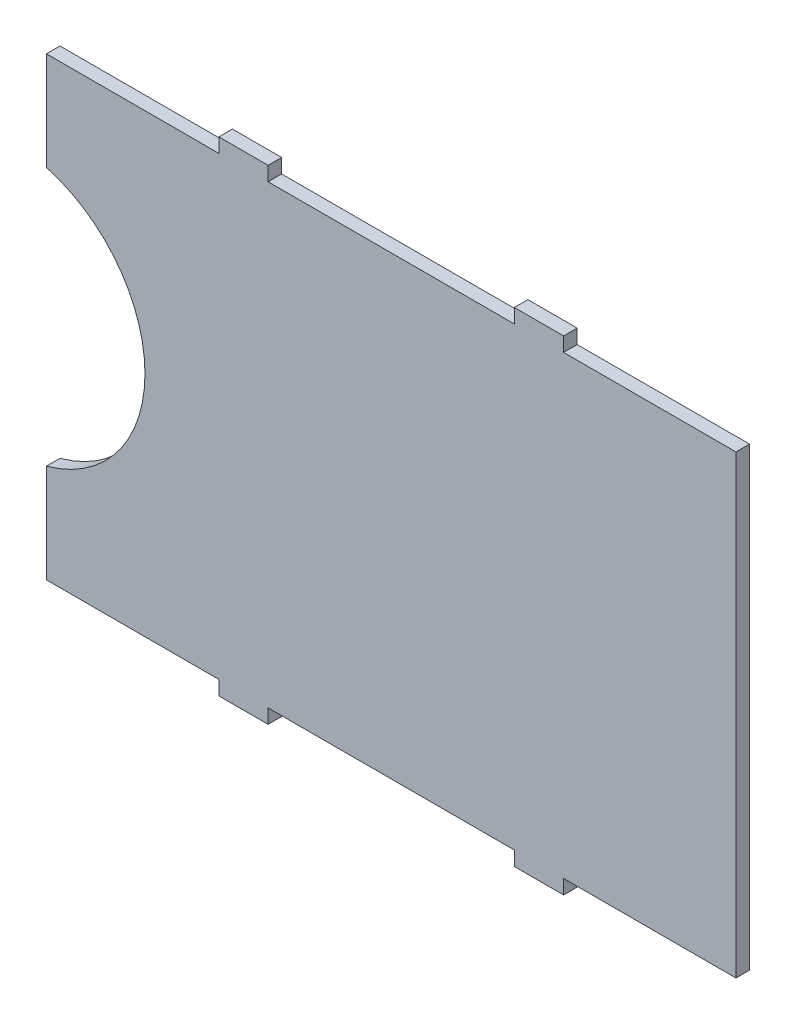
ISO-10303-21;
HEADER;
FILE_DESCRIPTION(('STEP AP214'),'2;1');
FILE_NAME('part.step','',(''),(''),'','','');
FILE_SCHEMA(('AUTOMOTIVE_DESIGN { 1 0 10303 214 1 1 1 1 }'));
ENDSEC;
DATA;
#1=APPLICATION_CONTEXT('core data for automotive mechanical design processes');
#2=APPLICATION_PROTOCOL_DEFINITION('international standard','automotive_design',2000,#1);
#3=PRODUCT_CONTEXT('',#1,'mechanical');
#4=PRODUCT('Part','Part','',(#3));
#5=PRODUCT_RELATED_PRODUCT_CATEGORY('part','',(#4));
#6=PRODUCT_DEFINITION_FORMATION('','',#4);
#7=PRODUCT_DEFINITION_CONTEXT('part definition',#1,'design');
#8=PRODUCT_DEFINITION('design','',#6,#7);
#9=PRODUCT_DEFINITION_SHAPE('','',#8);
#10=(LENGTH_UNIT() NAMED_UNIT(*) SI_UNIT(.MILLI.,.METRE.));
#11=(NAMED_UNIT(*) PLANE_ANGLE_UNIT() SI_UNIT($,.RADIAN.));
#12=(NAMED_UNIT(*) SI_UNIT($,.STERADIAN.) SOLID_ANGLE_UNIT());
#13=UNCERTAINTY_MEASURE_WITH_UNIT(LENGTH_MEASURE(1.E-05),#10,'distance_accuracy_value','');
#14=(GEOMETRIC_REPRESENTATION_CONTEXT(3) GLOBAL_UNCERTAINTY_ASSIGNED_CONTEXT((#13)) GLOBAL_UNIT_ASSIGNED_CONTEXT((#10,
#11,#12)) REPRESENTATION_CONTEXT('',''));
#15=CARTESIAN_POINT('',(0.,0.,0.));
#16=DIRECTION('',(0.,0.,1.));
#17=DIRECTION('',(1.,0.,0.));
#18=AXIS2_PLACEMENT_3D('',#15,#16,#17);
#19=CARTESIAN_POINT('',(0.,0.,5.5));
#20=DIRECTION('',(1.,0.,0.));
#21=DIRECTION('',(0.,0.,-1.));
#22=AXIS2_PLACEMENT_3D('',#19,#20,#21);
#23=PLANE('',#22);
#24=DIRECTION('',(0.,-1.,0.));
#25=VECTOR('',#24,1.);
#26=CARTESIAN_POINT('',(0.,0.,0.));
#27=LINE('',#26,#25);
#28=CARTESIAN_POINT('',(0.,185.,0.));
#29=VERTEX_POINT('',#28);
#30=CARTESIAN_POINT('',(0.,145.,0.));
#31=VERTEX_POINT('',#30);
#32=EDGE_CURVE('E261',#29,#31,#27,.T.);
#33=ORIENTED_EDGE('',*,*,#32,.T.);
#34=DIRECTION('',(0.,0.,1.));
#35=VECTOR('',#34,1.);
#36=CARTESIAN_POINT('',(0.,145.,0.));
#37=LINE('',#36,#35);
#38=CARTESIAN_POINT('',(0.,145.,5.5));
#39=VERTEX_POINT('',#38);
#40=EDGE_CURVE('E51',#31,#39,#37,.T.);
#41=ORIENTED_EDGE('',*,*,#40,.T.);
#42=DIRECTION('',(0.,-1.,0.));
#43=VECTOR('',#42,1.);
#44=CARTESIAN_POINT('',(0.,0.,5.5));
#45=LINE('',#44,#43);
#46=CARTESIAN_POINT('',(0.,185.,5.5));
#47=VERTEX_POINT('',#46);
#48=EDGE_CURVE('E217',#47,#39,#45,.T.);
#49=ORIENTED_EDGE('',*,*,#48,.F.);
#50=DIRECTION('',(0.,0.,-1.));
#51=VECTOR('',#50,1.);
#52=CARTESIAN_POINT('',(0.,185.,5.5));
#53=LINE('',#52,#51);
#54=EDGE_CURVE('E211',#47,#29,#53,.T.);
#55=ORIENTED_EDGE('',*,*,#54,.T.);
#56=EDGE_LOOP('',(#33,#41,#49,#55));
#57=FACE_BOUND('',#56,.T.);
#58=ADVANCED_FACE('F36',(#57),#23,.F.);
#59=CARTESIAN_POINT('',(70.,0.,5.5));
#60=DIRECTION('',(0.,1.,0.));
#61=DIRECTION('',(-1.,0.,0.));
#62=AXIS2_PLACEMENT_3D('',#59,#60,#61);
#63=PLANE('',#62);
#64=DIRECTION('',(1.,0.,0.));
#65=VECTOR('',#64,1.);
#66=CARTESIAN_POINT('',(70.,0.,0.));
#67=LINE('',#66,#65);
#68=CARTESIAN_POINT('',(0.,0.,0.));
#69=VERTEX_POINT('',#68);
#70=CARTESIAN_POINT('',(70.,0.,0.));
#71=VERTEX_POINT('',#70);
#72=EDGE_CURVE('E222',#69,#71,#67,.T.);
#73=ORIENTED_EDGE('',*,*,#72,.T.);
#74=DIRECTION('',(0.,0.,-1.));
#75=VECTOR('',#74,1.);
#76=CARTESIAN_POINT('',(70.,0.,5.5));
#77=LINE('',#76,#75);
#78=CARTESIAN_POINT('',(70.,0.,5.5));
#79=VERTEX_POINT('',#78);
#80=EDGE_CURVE('E11',#79,#71,#77,.T.);
#81=ORIENTED_EDGE('',*,*,#80,.F.);
#82=DIRECTION('',(1.,0.,0.));
#83=VECTOR('',#82,1.);
#84=CARTESIAN_POINT('',(70.,0.,5.5));
#85=LINE('',#84,#83);
#86=CARTESIAN_POINT('',(0.,0.,5.5));
#87=VERTEX_POINT('',#86);
#88=EDGE_CURVE('E264',#87,#79,#85,.T.);
#89=ORIENTED_EDGE('',*,*,#88,.F.);
#90=DIRECTION('',(0.,0.,-1.));
#91=VECTOR('',#90,1.);
#92=CARTESIAN_POINT('',(0.,0.,5.5));
#93=LINE('',#92,#91);
#94=EDGE_CURVE('E221',#87,#69,#93,.T.);
#95=ORIENTED_EDGE('',*,*,#94,.T.);
#96=EDGE_LOOP('',(#73,#81,#89,#95));
#97=FACE_BOUND('',#96,.T.);
#98=ADVANCED_FACE('F38',(#97),#63,.F.);
#99=CARTESIAN_POINT('',(70.,-5.80000000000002,5.5));
#100=DIRECTION('',(1.,0.,0.));
#101=DIRECTION('',(0.,0.,-1.));
#102=AXIS2_PLACEMENT_3D('',#99,#100,#101);
#103=PLANE('',#102);
#104=DIRECTION('',(0.,-1.,0.));
#105=VECTOR('',#104,1.);
#106=CARTESIAN_POINT('',(70.,-5.80000000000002,0.));
#107=LINE('',#106,#105);
#108=CARTESIAN_POINT('',(70.,-5.80000000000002,0.));
#109=VERTEX_POINT('',#108);
#110=EDGE_CURVE('E225',#71,#109,#107,.T.);
#111=ORIENTED_EDGE('',*,*,#110,.T.);
#112=DIRECTION('',(0.,0.,-1.));
#113=VECTOR('',#112,1.);
#114=CARTESIAN_POINT('',(70.,-5.80000000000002,5.5));
#115=LINE('',#114,#113);
#116=CARTESIAN_POINT('',(70.,-5.80000000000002,5.5));
#117=VERTEX_POINT('',#116);
#118=EDGE_CURVE('E44',#117,#109,#115,.T.);
#119=ORIENTED_EDGE('',*,*,#118,.F.);
#120=DIRECTION('',(0.,-1.,0.));
#121=VECTOR('',#120,1.);
#122=CARTESIAN_POINT('',(70.,-5.80000000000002,5.5));
#123=LINE('',#122,#121);
#124=EDGE_CURVE('E138',#79,#117,#123,.T.);
#125=ORIENTED_EDGE('',*,*,#124,.F.);
#126=ORIENTED_EDGE('',*,*,#80,.T.);
#127=EDGE_LOOP('',(#111,#119,#125,#126));
#128=FACE_BOUND('',#127,.T.);
#129=ADVANCED_FACE('F386',(#128),#103,.F.);
#130=CARTESIAN_POINT('',(90.,-5.80000000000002,5.5));
#131=DIRECTION('',(0.,1.,0.));
#132=DIRECTION('',(-1.,0.,0.));
#133=AXIS2_PLACEMENT_3D('',#130,#131,#132);
#134=PLANE('',#133);
#135=DIRECTION('',(1.,0.,0.));
#136=VECTOR('',#135,1.);
#137=CARTESIAN_POINT('',(90.,-5.80000000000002,0.));
#138=LINE('',#137,#136);
#139=CARTESIAN_POINT('',(90.,-5.80000000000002,0.));
#140=VERTEX_POINT('',#139);
#141=EDGE_CURVE('E228',#109,#140,#138,.T.);
#142=ORIENTED_EDGE('',*,*,#141,.T.);
#143=DIRECTION('',(0.,0.,-1.));
#144=VECTOR('',#143,1.);
#145=CARTESIAN_POINT('',(90.,-5.80000000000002,5.5));
#146=LINE('',#145,#144);
#147=CARTESIAN_POINT('',(90.,-5.80000000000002,5.5));
#148=VERTEX_POINT('',#147);
#149=EDGE_CURVE('E307',#148,#140,#146,.T.);
#150=ORIENTED_EDGE('',*,*,#149,.F.);
#151=DIRECTION('',(1.,0.,0.));
#152=VECTOR('',#151,1.);
#153=CARTESIAN_POINT('',(90.,-5.80000000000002,5.5));
#154=LINE('',#153,#152);
#155=EDGE_CURVE('E315',#117,#148,#154,.T.);
#156=ORIENTED_EDGE('',*,*,#155,.F.);
#157=ORIENTED_EDGE('',*,*,#118,.T.);
#158=EDGE_LOOP('',(#142,#150,#156,#157));
#159=FACE_BOUND('',#158,.T.);
#160=ADVANCED_FACE('F313',(#159),#134,.F.);
#161=CARTESIAN_POINT('',(90.,0.,5.5));
#162=DIRECTION('',(-1.,0.,0.));
#163=DIRECTION('',(0.,0.,1.));
#164=AXIS2_PLACEMENT_3D('',#161,#162,#163);
#165=PLANE('',#164);
#166=DIRECTION('',(0.,1.,0.));
#167=VECTOR('',#166,1.);
#168=CARTESIAN_POINT('',(90.,0.,0.));
#169=LINE('',#168,#167);
#170=CARTESIAN_POINT('',(90.,0.,0.));
#171=VERTEX_POINT('',#170);
#172=EDGE_CURVE('E230',#140,#171,#169,.T.);
#173=ORIENTED_EDGE('',*,*,#172,.T.);
#174=DIRECTION('',(0.,0.,-1.));
#175=VECTOR('',#174,1.);
#176=CARTESIAN_POINT('',(90.,0.,5.5));
#177=LINE('',#176,#175);
#178=CARTESIAN_POINT('',(90.,0.,5.5));
#179=VERTEX_POINT('',#178);
#180=EDGE_CURVE('E304',#179,#171,#177,.T.);
#181=ORIENTED_EDGE('',*,*,#180,.F.);
#182=DIRECTION('',(0.,1.,0.));
#183=VECTOR('',#182,1.);
#184=CARTESIAN_POINT('',(90.,0.,5.5));
#185=LINE('',#184,#183);
#186=EDGE_CURVE('E333',#148,#179,#185,.T.);
#187=ORIENTED_EDGE('',*,*,#186,.F.);
#188=ORIENTED_EDGE('',*,*,#149,.T.);
#189=EDGE_LOOP('',(#173,#181,#187,#188));
#190=FACE_BOUND('',#189,.T.);
#191=ADVANCED_FACE('F324',(#190),#165,.F.);
#192=CARTESIAN_POINT('',(190.,0.,5.5));
#193=DIRECTION('',(0.,1.,0.));
#194=DIRECTION('',(-1.,0.,0.));
#195=AXIS2_PLACEMENT_3D('',#192,#193,#194);
#196=PLANE('',#195);
#197=DIRECTION('',(1.,0.,0.));
#198=VECTOR('',#197,1.);
#199=CARTESIAN_POINT('',(190.,0.,0.));
#200=LINE('',#199,#198);
#201=CARTESIAN_POINT('',(190.,0.,0.));
#202=VERTEX_POINT('',#201);
#203=EDGE_CURVE('E232',#171,#202,#200,.T.);
#204=ORIENTED_EDGE('',*,*,#203,.T.);
#205=DIRECTION('',(0.,0.,-1.));
#206=VECTOR('',#205,1.);
#207=CARTESIAN_POINT('',(190.,0.,5.5));
#208=LINE('',#207,#206);
#209=CARTESIAN_POINT('',(190.,0.,5.5));
#210=VERTEX_POINT('',#209);
#211=EDGE_CURVE('E301',#210,#202,#208,.T.);
#212=ORIENTED_EDGE('',*,*,#211,.F.);
#213=DIRECTION('',(1.,0.,0.));
#214=VECTOR('',#213,1.);
#215=CARTESIAN_POINT('',(190.,0.,5.5));
#216=LINE('',#215,#214);
#217=EDGE_CURVE('E330',#179,#210,#216,.T.);
#218=ORIENTED_EDGE('',*,*,#217,.F.);
#219=ORIENTED_EDGE('',*,*,#180,.T.);
#220=EDGE_LOOP('',(#204,#212,#218,#219));
#221=FACE_BOUND('',#220,.T.);
#222=ADVANCED_FACE('F328',(#221),#196,.F.);
#223=CARTESIAN_POINT('',(190.,-5.80000000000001,5.5));
#224=DIRECTION('',(1.,0.,0.));
#225=DIRECTION('',(0.,0.,-1.));
#226=AXIS2_PLACEMENT_3D('',#223,#224,#225);
#227=PLANE('',#226);
#228=DIRECTION('',(0.,-1.,0.));
#229=VECTOR('',#228,1.);
#230=CARTESIAN_POINT('',(190.,-5.80000000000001,0.));
#231=LINE('',#230,#229);
#232=CARTESIAN_POINT('',(190.,-5.80000000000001,0.));
#233=VERTEX_POINT('',#232);
#234=EDGE_CURVE('E234',#202,#233,#231,.T.);
#235=ORIENTED_EDGE('',*,*,#234,.T.);
#236=DIRECTION('',(0.,0.,-1.));
#237=VECTOR('',#236,1.);
#238=CARTESIAN_POINT('',(190.,-5.80000000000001,5.5));
#239=LINE('',#238,#237);
#240=CARTESIAN_POINT('',(190.,-5.80000000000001,5.5));
#241=VERTEX_POINT('',#240);
#242=EDGE_CURVE('E298',#241,#233,#239,.T.);
#243=ORIENTED_EDGE('',*,*,#242,.F.);
#244=DIRECTION('',(0.,-1.,0.));
#245=VECTOR('',#244,1.);
#246=CARTESIAN_POINT('',(190.,-5.80000000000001,5.5));
#247=LINE('',#246,#245);
#248=EDGE_CURVE('E332',#210,#241,#247,.T.);
#249=ORIENTED_EDGE('',*,*,#248,.F.);
#250=ORIENTED_EDGE('',*,*,#211,.T.);
#251=EDGE_LOOP('',(#235,#243,#249,#250));
#252=FACE_BOUND('',#251,.T.);
#253=ADVANCED_FACE('F449',(#252),#227,.F.);
#254=CARTESIAN_POINT('',(210.,-5.80000000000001,5.5));
#255=DIRECTION('',(0.,1.,0.));
#256=DIRECTION('',(-1.,0.,0.));
#257=AXIS2_PLACEMENT_3D('',#254,#255,#256);
#258=PLANE('',#257);
#259=DIRECTION('',(1.,0.,0.));
#260=VECTOR('',#259,1.);
#261=CARTESIAN_POINT('',(210.,-5.80000000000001,0.));
#262=LINE('',#261,#260);
#263=CARTESIAN_POINT('',(210.,-5.80000000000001,0.));
#264=VERTEX_POINT('',#263);
#265=EDGE_CURVE('E236',#233,#264,#262,.T.);
#266=ORIENTED_EDGE('',*,*,#265,.T.);
#267=DIRECTION('',(0.,0.,-1.));
#268=VECTOR('',#267,1.);
#269=CARTESIAN_POINT('',(210.,-5.80000000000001,5.5));
#270=LINE('',#269,#268);
#271=CARTESIAN_POINT('',(210.,-5.80000000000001,5.5));
#272=VERTEX_POINT('',#271);
#273=EDGE_CURVE('E295',#272,#264,#270,.T.);
#274=ORIENTED_EDGE('',*,*,#273,.F.);
#275=DIRECTION('',(1.,0.,0.));
#276=VECTOR('',#275,1.);
#277=CARTESIAN_POINT('',(210.,-5.80000000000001,5.5));
#278=LINE('',#277,#276);
#279=EDGE_CURVE('E335',#241,#272,#278,.T.);
#280=ORIENTED_EDGE('',*,*,#279,.F.);
#281=ORIENTED_EDGE('',*,*,#242,.T.);
#282=EDGE_LOOP('',(#266,#274,#280,#281));
#283=FACE_BOUND('',#282,.T.);
#284=ADVANCED_FACE('F445',(#283),#258,.F.);
#285=CARTESIAN_POINT('',(210.,0.,5.5));
#286=DIRECTION('',(-1.,0.,0.));
#287=DIRECTION('',(0.,0.,1.));
#288=AXIS2_PLACEMENT_3D('',#285,#286,#287);
#289=PLANE('',#288);
#290=DIRECTION('',(0.,1.,0.));
#291=VECTOR('',#290,1.);
#292=CARTESIAN_POINT('',(210.,0.,0.));
#293=LINE('',#292,#291);
#294=CARTESIAN_POINT('',(210.,0.,0.));
#295=VERTEX_POINT('',#294);
#296=EDGE_CURVE('E238',#264,#295,#293,.T.);
#297=ORIENTED_EDGE('',*,*,#296,.T.);
#298=DIRECTION('',(0.,0.,-1.));
#299=VECTOR('',#298,1.);
#300=CARTESIAN_POINT('',(210.,0.,5.5));
#301=LINE('',#300,#299);
#302=CARTESIAN_POINT('',(210.,0.,5.5));
#303=VERTEX_POINT('',#302);
#304=EDGE_CURVE('E292',#303,#295,#301,.T.);
#305=ORIENTED_EDGE('',*,*,#304,.F.);
#306=DIRECTION('',(0.,1.,0.));
#307=VECTOR('',#306,1.);
#308=CARTESIAN_POINT('',(210.,0.,5.5));
#309=LINE('',#308,#307);
#310=EDGE_CURVE('E341',#272,#303,#309,.T.);
#311=ORIENTED_EDGE('',*,*,#310,.F.);
#312=ORIENTED_EDGE('',*,*,#273,.T.);
#313=EDGE_LOOP('',(#297,#305,#311,#312));
#314=FACE_BOUND('',#313,.T.);
#315=ADVANCED_FACE('F441',(#314),#289,.F.);
#316=CARTESIAN_POINT('',(280.,0.,5.5));
#317=DIRECTION('',(0.,1.,0.));
#318=DIRECTION('',(-1.,0.,0.));
#319=AXIS2_PLACEMENT_3D('',#316,#317,#318);
#320=PLANE('',#319);
#321=DIRECTION('',(1.,0.,0.));
#322=VECTOR('',#321,1.);
#323=CARTESIAN_POINT('',(280.,0.,0.));
#324=LINE('',#323,#322);
#325=CARTESIAN_POINT('',(280.,0.,0.));
#326=VERTEX_POINT('',#325);
#327=EDGE_CURVE('E240',#295,#326,#324,.T.);
#328=ORIENTED_EDGE('',*,*,#327,.T.);
#329=DIRECTION('',(0.,0.,-1.));
#330=VECTOR('',#329,1.);
#331=CARTESIAN_POINT('',(280.,0.,5.5));
#332=LINE('',#331,#330);
#333=CARTESIAN_POINT('',(280.,0.,5.5));
#334=VERTEX_POINT('',#333);
#335=EDGE_CURVE('E289',#334,#326,#332,.T.);
#336=ORIENTED_EDGE('',*,*,#335,.F.);
#337=DIRECTION('',(1.,0.,0.));
#338=VECTOR('',#337,1.);
#339=CARTESIAN_POINT('',(280.,0.,5.5));
#340=LINE('',#339,#338);
#341=EDGE_CURVE('E343',#303,#334,#340,.T.);
#342=ORIENTED_EDGE('',*,*,#341,.F.);
#343=ORIENTED_EDGE('',*,*,#304,.T.);
#344=EDGE_LOOP('',(#328,#336,#342,#343));
#345=FACE_BOUND('',#344,.T.);
#346=ADVANCED_FACE('F437',(#345),#320,.F.);
#347=CARTESIAN_POINT('',(280.,185.,5.5));
#348=DIRECTION('',(-1.,0.,0.));
#349=DIRECTION('',(0.,0.,1.));
#350=AXIS2_PLACEMENT_3D('',#347,#348,#349);
#351=PLANE('',#350);
#352=DIRECTION('',(0.,1.,0.));
#353=VECTOR('',#352,1.);
#354=CARTESIAN_POINT('',(280.,185.,0.));
#355=LINE('',#354,#353);
#356=CARTESIAN_POINT('',(280.,185.,0.));
#357=VERTEX_POINT('',#356);
#358=EDGE_CURVE('E242',#326,#357,#355,.T.);
#359=ORIENTED_EDGE('',*,*,#358,.T.);
#360=DIRECTION('',(0.,0.,-1.));
#361=VECTOR('',#360,1.);
#362=CARTESIAN_POINT('',(280.,185.,5.5));
#363=LINE('',#362,#361);
#364=CARTESIAN_POINT('',(280.,185.,5.5));
#365=VERTEX_POINT('',#364);
#366=EDGE_CURVE('E286',#365,#357,#363,.T.);
#367=ORIENTED_EDGE('',*,*,#366,.F.);
#368=DIRECTION('',(0.,1.,0.));
#369=VECTOR('',#368,1.);
#370=CARTESIAN_POINT('',(280.,185.,5.5));
#371=LINE('',#370,#369);
#372=EDGE_CURVE('E345',#334,#365,#371,.T.);
#373=ORIENTED_EDGE('',*,*,#372,.F.);
#374=ORIENTED_EDGE('',*,*,#335,.T.);
#375=EDGE_LOOP('',(#359,#367,#373,#374));
#376=FACE_BOUND('',#375,.T.);
#377=ADVANCED_FACE('F433',(#376),#351,.F.);
#378=CARTESIAN_POINT('',(210.,185.,5.5));
#379=DIRECTION('',(0.,-1.,0.));
#380=DIRECTION('',(0.,0.,-1.));
#381=AXIS2_PLACEMENT_3D('',#378,#379,#380);
#382=PLANE('',#381);
#383=DIRECTION('',(-1.,0.,0.));
#384=VECTOR('',#383,1.);
#385=CARTESIAN_POINT('',(210.,185.,0.));
#386=LINE('',#385,#384);
#387=CARTESIAN_POINT('',(210.,185.,0.));
#388=VERTEX_POINT('',#387);
#389=EDGE_CURVE('E244',#357,#388,#386,.T.);
#390=ORIENTED_EDGE('',*,*,#389,.T.);
#391=DIRECTION('',(0.,0.,-1.));
#392=VECTOR('',#391,1.);
#393=CARTESIAN_POINT('',(210.,185.,5.5));
#394=LINE('',#393,#392);
#395=CARTESIAN_POINT('',(210.,185.,5.5));
#396=VERTEX_POINT('',#395);
#397=EDGE_CURVE('E283',#396,#388,#394,.T.);
#398=ORIENTED_EDGE('',*,*,#397,.F.);
#399=DIRECTION('',(-1.,0.,0.));
#400=VECTOR('',#399,1.);
#401=CARTESIAN_POINT('',(210.,185.,5.5));
#402=LINE('',#401,#400);
#403=EDGE_CURVE('E347',#365,#396,#402,.T.);
#404=ORIENTED_EDGE('',*,*,#403,.F.);
#405=ORIENTED_EDGE('',*,*,#366,.T.);
#406=EDGE_LOOP('',(#390,#398,#404,#405));
#407=FACE_BOUND('',#406,.T.);
#408=ADVANCED_FACE('F429',(#407),#382,.F.);
#409=CARTESIAN_POINT('',(210.,190.8,5.5));
#410=DIRECTION('',(-1.,0.,0.));
#411=DIRECTION('',(0.,0.,1.));
#412=AXIS2_PLACEMENT_3D('',#409,#410,#411);
#413=PLANE('',#412);
#414=DIRECTION('',(0.,1.,0.));
#415=VECTOR('',#414,1.);
#416=CARTESIAN_POINT('',(210.,190.8,0.));
#417=LINE('',#416,#415);
#418=CARTESIAN_POINT('',(210.,190.8,0.));
#419=VERTEX_POINT('',#418);
#420=EDGE_CURVE('E246',#388,#419,#417,.T.);
#421=ORIENTED_EDGE('',*,*,#420,.T.);
#422=DIRECTION('',(0.,0.,-1.));
#423=VECTOR('',#422,1.);
#424=CARTESIAN_POINT('',(210.,190.8,5.5));
#425=LINE('',#424,#423);
#426=CARTESIAN_POINT('',(210.,190.8,5.5));
#427=VERTEX_POINT('',#426);
#428=EDGE_CURVE('E280',#427,#419,#425,.T.);
#429=ORIENTED_EDGE('',*,*,#428,.F.);
#430=DIRECTION('',(0.,1.,0.));
#431=VECTOR('',#430,1.);
#432=CARTESIAN_POINT('',(210.,190.8,5.5));
#433=LINE('',#432,#431);
#434=EDGE_CURVE('E349',#396,#427,#433,.T.);
#435=ORIENTED_EDGE('',*,*,#434,.F.);
#436=ORIENTED_EDGE('',*,*,#397,.T.);
#437=EDGE_LOOP('',(#421,#429,#435,#436));
#438=FACE_BOUND('',#437,.T.);
#439=ADVANCED_FACE('F425',(#438),#413,.F.);
#440=CARTESIAN_POINT('',(190.,190.8,5.5));
#441=DIRECTION('',(0.,-1.,0.));
#442=DIRECTION('',(0.,0.,-1.));
#443=AXIS2_PLACEMENT_3D('',#440,#441,#442);
#444=PLANE('',#443);
#445=DIRECTION('',(-1.,0.,0.));
#446=VECTOR('',#445,1.);
#447=CARTESIAN_POINT('',(190.,190.8,0.));
#448=LINE('',#447,#446);
#449=CARTESIAN_POINT('',(190.,190.8,0.));
#450=VERTEX_POINT('',#449);
#451=EDGE_CURVE('E248',#419,#450,#448,.T.);
#452=ORIENTED_EDGE('',*,*,#451,.T.);
#453=DIRECTION('',(0.,0.,-1.));
#454=VECTOR('',#453,1.);
#455=CARTESIAN_POINT('',(190.,190.8,5.5));
#456=LINE('',#455,#454);
#457=CARTESIAN_POINT('',(190.,190.8,5.5));
#458=VERTEX_POINT('',#457);
#459=EDGE_CURVE('E277',#458,#450,#456,.T.);
#460=ORIENTED_EDGE('',*,*,#459,.F.);
#461=DIRECTION('',(-1.,0.,0.));
#462=VECTOR('',#461,1.);
#463=CARTESIAN_POINT('',(190.,190.8,5.5));
#464=LINE('',#463,#462);
#465=EDGE_CURVE('E351',#427,#458,#464,.T.);
#466=ORIENTED_EDGE('',*,*,#465,.F.);
#467=ORIENTED_EDGE('',*,*,#428,.T.);
#468=EDGE_LOOP('',(#452,#460,#466,#467));
#469=FACE_BOUND('',#468,.T.);
#470=ADVANCED_FACE('F421',(#469),#444,.F.);
#471=CARTESIAN_POINT('',(190.,185.,5.5));
#472=DIRECTION('',(1.,0.,0.));
#473=DIRECTION('',(0.,0.,-1.));
#474=AXIS2_PLACEMENT_3D('',#471,#472,#473);
#475=PLANE('',#474);
#476=DIRECTION('',(0.,-1.,0.));
#477=VECTOR('',#476,1.);
#478=CARTESIAN_POINT('',(190.,185.,0.));
#479=LINE('',#478,#477);
#480=CARTESIAN_POINT('',(190.,185.,0.));
#481=VERTEX_POINT('',#480);
#482=EDGE_CURVE('E250',#450,#481,#479,.T.);
#483=ORIENTED_EDGE('',*,*,#482,.T.);
#484=DIRECTION('',(0.,0.,-1.));
#485=VECTOR('',#484,1.);
#486=CARTESIAN_POINT('',(190.,185.,5.5));
#487=LINE('',#486,#485);
#488=CARTESIAN_POINT('',(190.,185.,5.5));
#489=VERTEX_POINT('',#488);
#490=EDGE_CURVE('E274',#489,#481,#487,.T.);
#491=ORIENTED_EDGE('',*,*,#490,.F.);
#492=DIRECTION('',(0.,-1.,0.));
#493=VECTOR('',#492,1.);
#494=CARTESIAN_POINT('',(190.,185.,5.5));
#495=LINE('',#494,#493);
#496=EDGE_CURVE('E353',#458,#489,#495,.T.);
#497=ORIENTED_EDGE('',*,*,#496,.F.);
#498=ORIENTED_EDGE('',*,*,#459,.T.);
#499=EDGE_LOOP('',(#483,#491,#497,#498));
#500=FACE_BOUND('',#499,.T.);
#501=ADVANCED_FACE('F417',(#500),#475,.F.);
#502=CARTESIAN_POINT('',(90.,185.,5.5));
#503=DIRECTION('',(0.,-1.,0.));
#504=DIRECTION('',(0.,0.,-1.));
#505=AXIS2_PLACEMENT_3D('',#502,#503,#504);
#506=PLANE('',#505);
#507=DIRECTION('',(-1.,0.,0.));
#508=VECTOR('',#507,1.);
#509=CARTESIAN_POINT('',(90.,185.,0.));
#510=LINE('',#509,#508);
#511=CARTESIAN_POINT('',(90.,185.,0.));
#512=VERTEX_POINT('',#511);
#513=EDGE_CURVE('E252',#481,#512,#510,.T.);
#514=ORIENTED_EDGE('',*,*,#513,.T.);
#515=DIRECTION('',(0.,0.,-1.));
#516=VECTOR('',#515,1.);
#517=CARTESIAN_POINT('',(90.,185.,5.5));
#518=LINE('',#517,#516);
#519=CARTESIAN_POINT('',(90.,185.,5.5));
#520=VERTEX_POINT('',#519);
#521=EDGE_CURVE('E271',#520,#512,#518,.T.);
#522=ORIENTED_EDGE('',*,*,#521,.F.);
#523=DIRECTION('',(-1.,0.,0.));
#524=VECTOR('',#523,1.);
#525=CARTESIAN_POINT('',(90.,185.,5.5));
#526=LINE('',#525,#524);
#527=EDGE_CURVE('E355',#489,#520,#526,.T.);
#528=ORIENTED_EDGE('',*,*,#527,.F.);
#529=ORIENTED_EDGE('',*,*,#490,.T.);
#530=EDGE_LOOP('',(#514,#522,#528,#529));
#531=FACE_BOUND('',#530,.T.);
#532=ADVANCED_FACE('F414',(#531),#506,.F.);
#533=CARTESIAN_POINT('',(90.,190.8,5.5));
#534=DIRECTION('',(-1.,0.,0.));
#535=DIRECTION('',(0.,0.,1.));
#536=AXIS2_PLACEMENT_3D('',#533,#534,#535);
#537=PLANE('',#536);
#538=DIRECTION('',(0.,1.,0.));
#539=VECTOR('',#538,1.);
#540=CARTESIAN_POINT('',(90.,190.8,0.));
#541=LINE('',#540,#539);
#542=CARTESIAN_POINT('',(90.,190.8,0.));
#543=VERTEX_POINT('',#542);
#544=EDGE_CURVE('E254',#512,#543,#541,.T.);
#545=ORIENTED_EDGE('',*,*,#544,.T.);
#546=DIRECTION('',(0.,0.,-1.));
#547=VECTOR('',#546,1.);
#548=CARTESIAN_POINT('',(90.,190.8,5.5));
#549=LINE('',#548,#547);
#550=CARTESIAN_POINT('',(90.,190.8,5.5));
#551=VERTEX_POINT('',#550);
#552=EDGE_CURVE('E268',#551,#543,#549,.T.);
#553=ORIENTED_EDGE('',*,*,#552,.F.);
#554=DIRECTION('',(0.,1.,0.));
#555=VECTOR('',#554,1.);
#556=CARTESIAN_POINT('',(90.,190.8,5.5));
#557=LINE('',#556,#555);
#558=EDGE_CURVE('E357',#520,#551,#557,.T.);
#559=ORIENTED_EDGE('',*,*,#558,.F.);
#560=ORIENTED_EDGE('',*,*,#521,.T.);
#561=EDGE_LOOP('',(#545,#553,#559,#560));
#562=FACE_BOUND('',#561,.T.);
#563=ADVANCED_FACE('F363',(#562),#537,.F.);
#564=CARTESIAN_POINT('',(70.,190.8,5.5));
#565=DIRECTION('',(0.,-1.,0.));
#566=DIRECTION('',(0.,0.,-1.));
#567=AXIS2_PLACEMENT_3D('',#564,#565,#566);
#568=PLANE('',#567);
#569=DIRECTION('',(-1.,0.,0.));
#570=VECTOR('',#569,1.);
#571=CARTESIAN_POINT('',(70.,190.8,0.));
#572=LINE('',#571,#570);
#573=CARTESIAN_POINT('',(70.,190.8,0.));
#574=VERTEX_POINT('',#573);
#575=EDGE_CURVE('E256',#543,#574,#572,.T.);
#576=ORIENTED_EDGE('',*,*,#575,.T.);
#577=DIRECTION('',(0.,0.,-1.));
#578=VECTOR('',#577,1.);
#579=CARTESIAN_POINT('',(70.,190.8,5.5));
#580=LINE('',#579,#578);
#581=CARTESIAN_POINT('',(70.,190.8,5.5));
#582=VERTEX_POINT('',#581);
#583=EDGE_CURVE('E210',#582,#574,#580,.T.);
#584=ORIENTED_EDGE('',*,*,#583,.F.);
#585=DIRECTION('',(-1.,0.,0.));
#586=VECTOR('',#585,1.);
#587=CARTESIAN_POINT('',(70.,190.8,5.5));
#588=LINE('',#587,#586);
#589=EDGE_CURVE('E198',#551,#582,#588,.T.);
#590=ORIENTED_EDGE('',*,*,#589,.F.);
#591=ORIENTED_EDGE('',*,*,#552,.T.);
#592=EDGE_LOOP('',(#576,#584,#590,#591));
#593=FACE_BOUND('',#592,.T.);
#594=ADVANCED_FACE('F367',(#593),#568,.F.);
#595=CARTESIAN_POINT('',(70.,185.,5.5));
#596=DIRECTION('',(1.,0.,0.));
#597=DIRECTION('',(0.,0.,-1.));
#598=AXIS2_PLACEMENT_3D('',#595,#596,#597);
#599=PLANE('',#598);
#600=DIRECTION('',(0.,-1.,0.));
#601=VECTOR('',#600,1.);
#602=CARTESIAN_POINT('',(70.,185.,0.));
#603=LINE('',#602,#601);
#604=CARTESIAN_POINT('',(70.,185.,0.));
#605=VERTEX_POINT('',#604);
#606=EDGE_CURVE('E207',#574,#605,#603,.T.);
#607=ORIENTED_EDGE('',*,*,#606,.T.);
#608=DIRECTION('',(0.,0.,-1.));
#609=VECTOR('',#608,1.);
#610=CARTESIAN_POINT('',(70.,185.,5.5));
#611=LINE('',#610,#609);
#612=CARTESIAN_POINT('',(70.,185.,5.5));
#613=VERTEX_POINT('',#612);
#614=EDGE_CURVE('E204',#613,#605,#611,.T.);
#615=ORIENTED_EDGE('',*,*,#614,.F.);
#616=DIRECTION('',(0.,-1.,0.));
#617=VECTOR('',#616,1.);
#618=CARTESIAN_POINT('',(70.,185.,5.5));
#619=LINE('',#618,#617);
#620=EDGE_CURVE('E190',#582,#613,#619,.T.);
#621=ORIENTED_EDGE('',*,*,#620,.F.);
#622=ORIENTED_EDGE('',*,*,#583,.T.);
#623=EDGE_LOOP('',(#607,#615,#621,#622));
#624=FACE_BOUND('',#623,.T.);
#625=ADVANCED_FACE('F205',(#624),#599,.F.);
#626=CARTESIAN_POINT('',(0.,185.,5.5));
#627=DIRECTION('',(0.,-1.,0.));
#628=DIRECTION('',(0.,0.,-1.));
#629=AXIS2_PLACEMENT_3D('',#626,#627,#628);
#630=PLANE('',#629);
#631=DIRECTION('',(-1.,0.,0.));
#632=VECTOR('',#631,1.);
#633=CARTESIAN_POINT('',(0.,185.,0.));
#634=LINE('',#633,#632);
#635=EDGE_CURVE('E259',#605,#29,#634,.T.);
#636=ORIENTED_EDGE('',*,*,#635,.T.);
#637=ORIENTED_EDGE('',*,*,#54,.F.);
#638=DIRECTION('',(-1.,0.,0.));
#639=VECTOR('',#638,1.);
#640=CARTESIAN_POINT('',(0.,185.,5.5));
#641=LINE('',#640,#639);
#642=EDGE_CURVE('E195',#613,#47,#641,.T.);
#643=ORIENTED_EDGE('',*,*,#642,.F.);
#644=ORIENTED_EDGE('',*,*,#614,.T.);
#645=EDGE_LOOP('',(#636,#637,#643,#644));
#646=FACE_BOUND('',#645,.T.);
#647=ADVANCED_FACE('F213',(#646),#630,.F.);
#648=CARTESIAN_POINT('',(0.,40.,5.5));
#649=VERTEX_POINT('',#648);
#650=EDGE_CURVE('E60',#649,#87,#45,.T.);
#651=ORIENTED_EDGE('',*,*,#650,.F.);
#652=DIRECTION('',(0.,0.,1.));
#653=VECTOR('',#652,1.);
#654=CARTESIAN_POINT('',(0.,40.,0.));
#655=LINE('',#654,#653);
#656=CARTESIAN_POINT('',(0.,40.,0.));
#657=VERTEX_POINT('',#656);
#658=EDGE_CURVE('E226',#657,#649,#655,.T.);
#659=ORIENTED_EDGE('',*,*,#658,.F.);
#660=EDGE_CURVE('E130',#657,#69,#27,.T.);
#661=ORIENTED_EDGE('',*,*,#660,.T.);
#662=ORIENTED_EDGE('',*,*,#94,.F.);
#663=EDGE_LOOP('',(#651,#659,#661,#662));
#664=FACE_BOUND('',#663,.T.);
#665=ADVANCED_FACE('F377',(#664),#23,.F.);
#666=CARTESIAN_POINT('',(0.,0.,5.5));
#667=DIRECTION('',(0.,0.,-1.));
#668=DIRECTION('',(-1.,0.,0.));
#669=AXIS2_PLACEMENT_3D('',#666,#667,#668);
#670=PLANE('',#669);
#671=ORIENTED_EDGE('',*,*,#48,.T.);
#672=CARTESIAN_POINT('',(-14.453125,92.5,5.5));
#673=DIRECTION('',(0.,0.,1.));
#674=DIRECTION('',(-1.,0.,0.));
#675=AXIS2_PLACEMENT_3D('',#672,#673,#674);
#676=CIRCLE('',#675,54.453125);
#677=EDGE_CURVE('E371',#649,#39,#676,.T.);
#678=ORIENTED_EDGE('',*,*,#677,.F.);
#679=ORIENTED_EDGE('',*,*,#650,.T.);
#680=ORIENTED_EDGE('',*,*,#88,.T.);
#681=ORIENTED_EDGE('',*,*,#124,.T.);
#682=ORIENTED_EDGE('',*,*,#155,.T.);
#683=ORIENTED_EDGE('',*,*,#186,.T.);
#684=ORIENTED_EDGE('',*,*,#217,.T.);
#685=ORIENTED_EDGE('',*,*,#248,.T.);
#686=ORIENTED_EDGE('',*,*,#279,.T.);
#687=ORIENTED_EDGE('',*,*,#310,.T.);
#688=ORIENTED_EDGE('',*,*,#341,.T.);
#689=ORIENTED_EDGE('',*,*,#372,.T.);
#690=ORIENTED_EDGE('',*,*,#403,.T.);
#691=ORIENTED_EDGE('',*,*,#434,.T.);
#692=ORIENTED_EDGE('',*,*,#465,.T.);
#693=ORIENTED_EDGE('',*,*,#496,.T.);
#694=ORIENTED_EDGE('',*,*,#527,.T.);
#695=ORIENTED_EDGE('',*,*,#558,.T.);
#696=ORIENTED_EDGE('',*,*,#589,.T.);
#697=ORIENTED_EDGE('',*,*,#620,.T.);
#698=ORIENTED_EDGE('',*,*,#642,.T.);
#699=EDGE_LOOP('',(#671,#678,#679,#680,#681,#682,#683,#684,#685,#686,#687,#688,#689,#690,#691,
#692,#693,#694,#695,#696,#697,#698));
#700=FACE_BOUND('',#699,.T.);
#701=ADVANCED_FACE('F193',(#700),#670,.F.);
#702=CARTESIAN_POINT('',(0.,0.,0.));
#703=DIRECTION('',(0.,0.,-1.));
#704=DIRECTION('',(-1.,0.,0.));
#705=AXIS2_PLACEMENT_3D('',#702,#703,#704);
#706=PLANE('',#705);
#707=CARTESIAN_POINT('',(-14.453125,92.5,0.));
#708=DIRECTION('',(0.,0.,1.));
#709=DIRECTION('',(-1.,0.,0.));
#710=AXIS2_PLACEMENT_3D('',#707,#708,#709);
#711=CIRCLE('',#710,54.453125);
#712=EDGE_CURVE('E374',#657,#31,#711,.T.);
#713=ORIENTED_EDGE('',*,*,#712,.T.);
#714=ORIENTED_EDGE('',*,*,#32,.F.);
#715=ORIENTED_EDGE('',*,*,#635,.F.);
#716=ORIENTED_EDGE('',*,*,#606,.F.);
#717=ORIENTED_EDGE('',*,*,#575,.F.);
#718=ORIENTED_EDGE('',*,*,#544,.F.);
#719=ORIENTED_EDGE('',*,*,#513,.F.);
#720=ORIENTED_EDGE('',*,*,#482,.F.);
#721=ORIENTED_EDGE('',*,*,#451,.F.);
#722=ORIENTED_EDGE('',*,*,#420,.F.);
#723=ORIENTED_EDGE('',*,*,#389,.F.);
#724=ORIENTED_EDGE('',*,*,#358,.F.);
#725=ORIENTED_EDGE('',*,*,#327,.F.);
#726=ORIENTED_EDGE('',*,*,#296,.F.);
#727=ORIENTED_EDGE('',*,*,#265,.F.);
#728=ORIENTED_EDGE('',*,*,#234,.F.);
#729=ORIENTED_EDGE('',*,*,#203,.F.);
#730=ORIENTED_EDGE('',*,*,#172,.F.);
#731=ORIENTED_EDGE('',*,*,#141,.F.);
#732=ORIENTED_EDGE('',*,*,#110,.F.);
#733=ORIENTED_EDGE('',*,*,#72,.F.);
#734=ORIENTED_EDGE('',*,*,#660,.F.);
#735=EDGE_LOOP('',(#713,#714,#715,#716,#717,#718,#719,#720,#721,#722,#723,#724,#725,#726,#727,
#728,#729,#730,#731,#732,#733,#734));
#736=FACE_BOUND('',#735,.T.);
#737=ADVANCED_FACE('F318',(#736),#706,.T.);
#738=CARTESIAN_POINT('',(-14.453125,92.5,0.));
#739=DIRECTION('',(0.,0.,1.));
#740=DIRECTION('',(1.,0.,0.));
#741=AXIS2_PLACEMENT_3D('',#738,#739,#740);
#742=CYLINDRICAL_SURFACE('',#741,54.453125);
#743=ORIENTED_EDGE('',*,*,#677,.T.);
#744=ORIENTED_EDGE('',*,*,#40,.F.);
#745=ORIENTED_EDGE('',*,*,#712,.F.);
#746=ORIENTED_EDGE('',*,*,#658,.T.);
#747=EDGE_LOOP('',(#743,#744,#745,#746));
#748=FACE_BOUND('',#747,.T.);
#749=ADVANCED_FACE('F375',(#748),#742,.F.);
#750=CLOSED_SHELL('',(#58,#98,#129,#160,#191,#222,#253,#284,#315,#346,#377,#408,#439,#470,#501,
#532,#563,#594,#625,#647,#665,#701,#737,#749));
#751=MANIFOLD_SOLID_BREP('B2',#750);
#752=ADVANCED_BREP_SHAPE_REPRESENTATION('',(#18,#751),#14);
#753=SHAPE_DEFINITION_REPRESENTATION(#9,#752);
ENDSEC;
END-ISO-10303-21;
